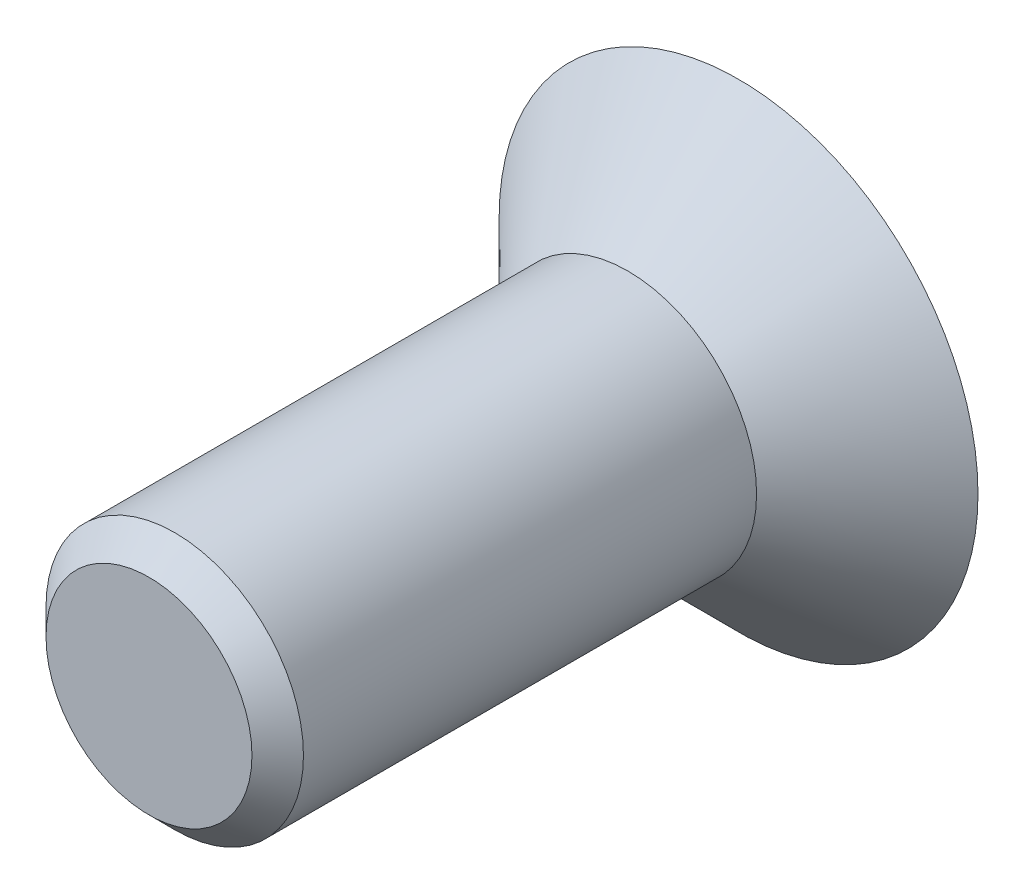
ISO-10303-21;
HEADER;
FILE_DESCRIPTION(('STEP AP214'),'2;1');
FILE_NAME('part.step','',(''),(''),'','','');
FILE_SCHEMA(('AUTOMOTIVE_DESIGN { 1 0 10303 214 1 1 1 1 }'));
ENDSEC;
DATA;
#1=APPLICATION_CONTEXT('core data for automotive mechanical design processes');
#2=APPLICATION_PROTOCOL_DEFINITION('international standard','automotive_design',2000,#1);
#3=PRODUCT_CONTEXT('',#1,'mechanical');
#4=PRODUCT('Part','Part','',(#3));
#5=PRODUCT_RELATED_PRODUCT_CATEGORY('part','',(#4));
#6=PRODUCT_DEFINITION_FORMATION('','',#4);
#7=PRODUCT_DEFINITION_CONTEXT('part definition',#1,'design');
#8=PRODUCT_DEFINITION('design','',#6,#7);
#9=PRODUCT_DEFINITION_SHAPE('','',#8);
#10=(LENGTH_UNIT() NAMED_UNIT(*) SI_UNIT(.MILLI.,.METRE.));
#11=(NAMED_UNIT(*) PLANE_ANGLE_UNIT() SI_UNIT($,.RADIAN.));
#12=(NAMED_UNIT(*) SI_UNIT($,.STERADIAN.) SOLID_ANGLE_UNIT());
#13=UNCERTAINTY_MEASURE_WITH_UNIT(LENGTH_MEASURE(1.E-05),#10,'distance_accuracy_value','');
#14=(GEOMETRIC_REPRESENTATION_CONTEXT(3) GLOBAL_UNCERTAINTY_ASSIGNED_CONTEXT((#13)) GLOBAL_UNIT_ASSIGNED_CONTEXT((#10,
#11,#12)) REPRESENTATION_CONTEXT('',''));
#15=CARTESIAN_POINT('',(0.,0.,0.));
#16=DIRECTION('',(0.,0.,1.));
#17=DIRECTION('',(1.,0.,0.));
#18=AXIS2_PLACEMENT_3D('',#15,#16,#17);
#19=CARTESIAN_POINT('',(0.,0.,-2.15));
#20=DIRECTION('',(0.,0.,1.));
#21=DIRECTION('',(1.,0.,0.));
#22=AXIS2_PLACEMENT_3D('',#19,#20,#21);
#23=PLANE('',#22);
#24=CARTESIAN_POINT('',(0.,0.,-2.14999999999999));
#25=DIRECTION('',(0.,0.,-1.));
#26=DIRECTION('',(-1.,0.,0.));
#27=AXIS2_PLACEMENT_3D('',#24,#25,#26);
#28=CIRCLE('',#27,4.65);
#29=CARTESIAN_POINT('',(-4.65000000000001,0.,-2.14999999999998));
#30=VERTEX_POINT('',#29);
#31=EDGE_CURVE('E98',#30,#30,#28,.T.);
#32=ORIENTED_EDGE('',*,*,#31,.T.);
#33=EDGE_LOOP('',(#32));
#34=FACE_BOUND('',#33,.T.);
#35=DIRECTION('',(-0.866025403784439,0.499999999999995,0.));
#36=VECTOR('',#35,1.);
#37=CARTESIAN_POINT('',(0.,1.73205080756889,-2.14999999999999));
#38=LINE('',#37,#36);
#39=CARTESIAN_POINT('',(1.49999999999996,0.866025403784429,-2.14999999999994));
#40=VERTEX_POINT('',#39);
#41=CARTESIAN_POINT('',(0.,1.73205080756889,-2.14999999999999));
#42=VERTEX_POINT('',#41);
#43=EDGE_CURVE('E45',#40,#42,#38,.T.);
#44=ORIENTED_EDGE('',*,*,#43,.T.);
#45=DIRECTION('',(-0.866025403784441,-0.500000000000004,0.));
#46=VECTOR('',#45,1.);
#47=CARTESIAN_POINT('',(-1.50000000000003,0.866025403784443,-2.15000000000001));
#48=LINE('',#47,#46);
#49=CARTESIAN_POINT('',(-1.50000000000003,0.866025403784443,-2.15000000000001));
#50=VERTEX_POINT('',#49);
#51=EDGE_CURVE('E97',#42,#50,#48,.T.);
#52=ORIENTED_EDGE('',*,*,#51,.T.);
#53=DIRECTION('',(0.,-1.,0.));
#54=VECTOR('',#53,1.);
#55=CARTESIAN_POINT('',(-1.50000000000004,-0.866025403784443,-2.14999999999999));
#56=LINE('',#55,#54);
#57=CARTESIAN_POINT('',(-1.50000000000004,-0.866025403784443,-2.14999999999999));
#58=VERTEX_POINT('',#57);
#59=EDGE_CURVE('E148',#50,#58,#56,.T.);
#60=ORIENTED_EDGE('',*,*,#59,.T.);
#61=DIRECTION('',(0.866025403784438,-0.499999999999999,0.));
#62=VECTOR('',#61,1.);
#63=CARTESIAN_POINT('',(-1.50000000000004,-0.866025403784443,-2.14999999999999));
#64=LINE('',#63,#62);
#65=CARTESIAN_POINT('',(0.,-1.73205080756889,-2.15));
#66=VERTEX_POINT('',#65);
#67=EDGE_CURVE('E154',#58,#66,#64,.T.);
#68=ORIENTED_EDGE('',*,*,#67,.T.);
#69=DIRECTION('',(0.866025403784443,0.500000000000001,0.));
#70=VECTOR('',#69,1.);
#71=CARTESIAN_POINT('',(0.,-1.73205080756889,-2.15));
#72=LINE('',#71,#70);
#73=CARTESIAN_POINT('',(1.49999999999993,-0.866025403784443,-2.14999999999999));
#74=VERTEX_POINT('',#73);
#75=EDGE_CURVE('E157',#66,#74,#72,.T.);
#76=ORIENTED_EDGE('',*,*,#75,.T.);
#77=DIRECTION('',(0.,1.,0.));
#78=VECTOR('',#77,1.);
#79=CARTESIAN_POINT('',(1.49999999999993,-0.866025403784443,-2.14999999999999));
#80=LINE('',#79,#78);
#81=EDGE_CURVE('E145',#74,#40,#80,.T.);
#82=ORIENTED_EDGE('',*,*,#81,.T.);
#83=EDGE_LOOP('',(#44,#52,#60,#68,#76,#82));
#84=FACE_BOUND('',#83,.T.);
#85=ADVANCED_FACE('F31',(#34,#84),#23,.F.);
#86=CARTESIAN_POINT('',(0.,0.,0.));
#87=DIRECTION('',(0.,0.,-1.));
#88=DIRECTION('',(-1.,0.,0.));
#89=AXIS2_PLACEMENT_3D('',#86,#87,#88);
#90=CONICAL_SURFACE('',#89,2.5,0.78539816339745);
#91=CARTESIAN_POINT('',(0.,0.,0.));
#92=DIRECTION('',(0.,0.,1.));
#93=DIRECTION('',(1.,0.,0.));
#94=AXIS2_PLACEMENT_3D('',#91,#92,#93);
#95=CIRCLE('',#94,2.5);
#96=CARTESIAN_POINT('',(-2.50000000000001,0.,0.));
#97=VERTEX_POINT('',#96);
#98=EDGE_CURVE('E146',#97,#97,#95,.T.);
#99=CARTESIAN_POINT('',(-4.65000000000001,0.,-2.14999999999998));
#100=CARTESIAN_POINT('',(-4.62760416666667,0.,-2.12760416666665));
#101=CARTESIAN_POINT('',(-4.60520833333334,0.,-2.10520833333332));
#102=CARTESIAN_POINT('',(-4.56041666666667,0.,-2.06041666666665));
#103=CARTESIAN_POINT('',(-4.53802083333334,0.,-2.03802083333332));
#104=CARTESIAN_POINT('',(-4.49322916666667,0.,-1.99322916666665));
#105=CARTESIAN_POINT('',(-4.47083333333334,0.,-1.97083333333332));
#106=CARTESIAN_POINT('',(-4.42604166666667,0.,-1.92604166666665));
#107=CARTESIAN_POINT('',(-4.40364583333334,0.,-1.90364583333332));
#108=CARTESIAN_POINT('',(-4.35885416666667,0.,-1.85885416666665));
#109=CARTESIAN_POINT('',(-4.33645833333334,0.,-1.83645833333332));
#110=CARTESIAN_POINT('',(-4.29166666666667,0.,-1.79166666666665));
#111=CARTESIAN_POINT('',(-4.26927083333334,0.,-1.76927083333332));
#112=CARTESIAN_POINT('',(-4.22447916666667,0.,-1.72447916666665));
#113=CARTESIAN_POINT('',(-4.20208333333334,0.,-1.70208333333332));
#114=CARTESIAN_POINT('',(-4.15729166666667,0.,-1.65729166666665));
#115=CARTESIAN_POINT('',(-4.13489583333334,0.,-1.63489583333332));
#116=CARTESIAN_POINT('',(-4.09010416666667,0.,-1.59010416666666));
#117=CARTESIAN_POINT('',(-4.06770833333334,0.,-1.56770833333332));
#118=CARTESIAN_POINT('',(-4.02291666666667,0.,-1.52291666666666));
#119=CARTESIAN_POINT('',(-4.00052083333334,0.,-1.50052083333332));
#120=CARTESIAN_POINT('',(-3.95572916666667,0.,-1.45572916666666));
#121=CARTESIAN_POINT('',(-3.93333333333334,0.,-1.43333333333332));
#122=CARTESIAN_POINT('',(-3.88854166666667,0.,-1.38854166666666));
#123=CARTESIAN_POINT('',(-3.86614583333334,0.,-1.36614583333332));
#124=CARTESIAN_POINT('',(-3.82135416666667,0.,-1.32135416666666));
#125=CARTESIAN_POINT('',(-3.79895833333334,0.,-1.29895833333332));
#126=CARTESIAN_POINT('',(-3.75416666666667,0.,-1.25416666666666));
#127=CARTESIAN_POINT('',(-3.73177083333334,0.,-1.23177083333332));
#128=CARTESIAN_POINT('',(-3.68697916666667,0.,-1.18697916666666));
#129=CARTESIAN_POINT('',(-3.66458333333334,0.,-1.16458333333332));
#130=CARTESIAN_POINT('',(-3.61979166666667,0.,-1.11979166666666));
#131=CARTESIAN_POINT('',(-3.59739583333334,0.,-1.09739583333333));
#132=CARTESIAN_POINT('',(-3.55260416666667,0.,-1.05260416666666));
#133=CARTESIAN_POINT('',(-3.53020833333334,0.,-1.03020833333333));
#134=CARTESIAN_POINT('',(-3.48541666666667,0.,-0.985416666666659));
#135=CARTESIAN_POINT('',(-3.46302083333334,0.,-0.963020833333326));
#136=CARTESIAN_POINT('',(-3.41822916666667,0.,-0.91822916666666));
#137=CARTESIAN_POINT('',(-3.39583333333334,0.,-0.895833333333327));
#138=CARTESIAN_POINT('',(-3.35104166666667,0.,-0.85104166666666));
#139=CARTESIAN_POINT('',(-3.32864583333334,0.,-0.828645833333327));
#140=CARTESIAN_POINT('',(-3.28385416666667,0.,-0.783854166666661));
#141=CARTESIAN_POINT('',(-3.26145833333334,0.,-0.761458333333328));
#142=CARTESIAN_POINT('',(-3.21666666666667,0.,-0.716666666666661));
#143=CARTESIAN_POINT('',(-3.19427083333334,0.,-0.694270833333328));
#144=CARTESIAN_POINT('',(-3.14947916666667,0.,-0.649479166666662));
#145=CARTESIAN_POINT('',(-3.12708333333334,0.,-0.627083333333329));
#146=CARTESIAN_POINT('',(-3.08229166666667,0.,-0.582291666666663));
#147=CARTESIAN_POINT('',(-3.05989583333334,0.,-0.559895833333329));
#148=CARTESIAN_POINT('',(-3.01510416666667,0.,-0.515104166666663));
#149=CARTESIAN_POINT('',(-2.99270833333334,0.,-0.492708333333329));
#150=CARTESIAN_POINT('',(-2.94791666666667,0.,-0.447916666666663));
#151=CARTESIAN_POINT('',(-2.92552083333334,0.,-0.42552083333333));
#152=CARTESIAN_POINT('',(-2.88072916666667,0.,-0.380729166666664));
#153=CARTESIAN_POINT('',(-2.85833333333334,0.,-0.358333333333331));
#154=CARTESIAN_POINT('',(-2.81354166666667,0.,-0.313541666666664));
#155=CARTESIAN_POINT('',(-2.79114583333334,0.,-0.291145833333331));
#156=CARTESIAN_POINT('',(-2.74635416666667,0.,-0.246354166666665));
#157=CARTESIAN_POINT('',(-2.72395833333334,0.,-0.223958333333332));
#158=CARTESIAN_POINT('',(-2.67916666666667,0.,-0.179166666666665));
#159=CARTESIAN_POINT('',(-2.65677083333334,0.,-0.156770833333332));
#160=CARTESIAN_POINT('',(-2.61197916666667,0.,-0.111979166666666));
#161=CARTESIAN_POINT('',(-2.58958333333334,0.,-0.0895833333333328));
#162=CARTESIAN_POINT('',(-2.54479166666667,0.,-0.0447916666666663));
#163=CARTESIAN_POINT('',(-2.52239583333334,0.,-0.0223958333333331));
#164=CARTESIAN_POINT('',(-2.50000000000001,0.,0.));
#165=B_SPLINE_CURVE_WITH_KNOTS('',3,(#99,#100,#101,#102,#103,#104,#105,#106,#107,#108,#109,#110,
#111,#112,#113,#114,#115,#116,#117,#118,#119,#120,#121,#122,#123,#124,#125,#126,#127,#128,#129,
#130,#131,#132,#133,#134,#135,#136,#137,#138,#139,#140,#141,#142,#143,#144,#145,#146,#147,#148,
#149,#150,#151,#152,#153,#154,#155,#156,#157,#158,#159,#160,#161,#162,#163,#164),.UNSPECIFIED.,
.F.,.F.,(4,2,2,2,2,2,2,2,2,2,2,2,2,2,2,2,2,2,2,2,2,2,2,2,2,2,2,2,2,2,2,2,4),(0.,
0.0950174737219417,0.190034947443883,0.285052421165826,0.380069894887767,0.47508736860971,
0.570104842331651,0.665122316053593,0.760139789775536,0.855157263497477,0.950174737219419,
1.04519221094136,1.1402096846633,1.23522715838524,1.33024463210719,1.42526210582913,
1.52027957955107,1.61529705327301,1.71031452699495,1.8053320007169,1.90034947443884,
1.99536694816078,2.09038442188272,2.18540189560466,2.28041936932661,2.37543684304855,
2.47045431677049,2.56547179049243,2.66048926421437,2.75550673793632,2.85052421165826,
2.9455416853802,3.04055915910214),.UNSPECIFIED.);
#166=EDGE_CURVE('BSEAM133',#30,#97,#165,.T.);
#167=ORIENTED_EDGE('',*,*,#31,.F.);
#168=ORIENTED_EDGE('',*,*,#98,.F.);
#169=ORIENTED_EDGE('',*,*,#166,.T.);
#170=ORIENTED_EDGE('',*,*,#166,.F.);
#171=EDGE_LOOP('',(#167,#169,#168,#170));
#172=FACE_BOUND('',#171,.T.);
#173=ADVANCED_FACE('F133',(#172),#90,.T.);
#174=CARTESIAN_POINT('',(0.,1.73205080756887,0.250000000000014));
#175=DIRECTION('',(-0.500000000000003,-0.866025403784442,0.));
#176=DIRECTION('',(0.866025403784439,-0.499999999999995,0.));
#177=AXIS2_PLACEMENT_3D('',#174,#175,#176);
#178=PLANE('',#177);
#179=DIRECTION('',(-0.866025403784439,0.499999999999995,0.));
#180=VECTOR('',#179,1.);
#181=CARTESIAN_POINT('',(0.749999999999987,1.29903810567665,0.));
#182=LINE('',#181,#180);
#183=CARTESIAN_POINT('',(1.5,0.866025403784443,0.));
#184=VERTEX_POINT('',#183);
#185=CARTESIAN_POINT('',(0.,1.73205080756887,0.));
#186=VERTEX_POINT('',#185);
#187=EDGE_CURVE('E84',#184,#186,#182,.T.);
#188=ORIENTED_EDGE('',*,*,#187,.T.);
#189=DIRECTION('',(0.,0.,-1.));
#190=VECTOR('',#189,1.);
#191=CARTESIAN_POINT('',(0.,1.73205080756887,0.250000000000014));
#192=LINE('',#191,#190);
#193=EDGE_CURVE('E91',#186,#42,#192,.T.);
#194=ORIENTED_EDGE('',*,*,#193,.T.);
#195=ORIENTED_EDGE('',*,*,#43,.F.);
#196=DIRECTION('',(0.,0.,-1.));
#197=VECTOR('',#196,1.);
#198=CARTESIAN_POINT('',(1.49999999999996,0.866025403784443,0.250000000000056));
#199=LINE('',#198,#197);
#200=EDGE_CURVE('E93',#184,#40,#199,.T.);
#201=ORIENTED_EDGE('',*,*,#200,.F.);
#202=EDGE_LOOP('',(#188,#194,#195,#201));
#203=FACE_BOUND('',#202,.T.);
#204=ADVANCED_FACE('F90',(#203),#178,.T.);
#205=CARTESIAN_POINT('',(-1.50000000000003,0.866025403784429,0.25));
#206=DIRECTION('',(0.499999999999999,-0.866025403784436,0.));
#207=DIRECTION('',(0.866025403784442,0.500000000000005,0.));
#208=AXIS2_PLACEMENT_3D('',#205,#206,#207);
#209=PLANE('',#208);
#210=DIRECTION('',(-0.866025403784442,-0.500000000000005,0.));
#211=VECTOR('',#210,1.);
#212=CARTESIAN_POINT('',(-0.750000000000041,1.29903810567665,0.));
#213=LINE('',#212,#211);
#214=CARTESIAN_POINT('',(-1.50000000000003,0.866025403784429,0.));
#215=VERTEX_POINT('',#214);
#216=EDGE_CURVE('E81',#186,#215,#213,.T.);
#217=ORIENTED_EDGE('',*,*,#216,.T.);
#218=DIRECTION('',(0.,0.,-1.));
#219=VECTOR('',#218,1.);
#220=CARTESIAN_POINT('',(-1.50000000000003,0.866025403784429,0.25));
#221=LINE('',#220,#219);
#222=EDGE_CURVE('E99',#215,#50,#221,.T.);
#223=ORIENTED_EDGE('',*,*,#222,.T.);
#224=ORIENTED_EDGE('',*,*,#51,.F.);
#225=ORIENTED_EDGE('',*,*,#193,.F.);
#226=EDGE_LOOP('',(#217,#223,#224,#225));
#227=FACE_BOUND('',#226,.T.);
#228=ADVANCED_FACE('F95',(#227),#209,.T.);
#229=CARTESIAN_POINT('',(-1.50000000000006,-0.866025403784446,0.250000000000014));
#230=DIRECTION('',(1.,0.,0.));
#231=DIRECTION('',(0.,0.,-1.));
#232=AXIS2_PLACEMENT_3D('',#229,#230,#231);
#233=PLANE('',#232);
#234=DIRECTION('',(0.,-1.,0.));
#235=VECTOR('',#234,1.);
#236=CARTESIAN_POINT('',(-1.50000000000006,0.,0.));
#237=LINE('',#236,#235);
#238=CARTESIAN_POINT('',(-1.50000000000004,-0.86602540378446,0.));
#239=VERTEX_POINT('',#238);
#240=EDGE_CURVE('E53',#215,#239,#237,.T.);
#241=ORIENTED_EDGE('',*,*,#240,.T.);
#242=DIRECTION('',(0.,0.,-1.));
#243=VECTOR('',#242,1.);
#244=CARTESIAN_POINT('',(-1.50000000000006,-0.866025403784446,0.250000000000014));
#245=LINE('',#244,#243);
#246=EDGE_CURVE('E104',#239,#58,#245,.T.);
#247=ORIENTED_EDGE('',*,*,#246,.T.);
#248=ORIENTED_EDGE('',*,*,#59,.F.);
#249=ORIENTED_EDGE('',*,*,#222,.F.);
#250=EDGE_LOOP('',(#241,#247,#248,#249));
#251=FACE_BOUND('',#250,.T.);
#252=ADVANCED_FACE('F168',(#251),#233,.T.);
#253=CARTESIAN_POINT('',(-1.50000000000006,-0.866025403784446,0.250000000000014));
#254=DIRECTION('',(0.500000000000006,0.866025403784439,0.));
#255=DIRECTION('',(-0.866025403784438,0.499999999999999,0.));
#256=AXIS2_PLACEMENT_3D('',#253,#254,#255);
#257=PLANE('',#256);
#258=DIRECTION('',(0.866025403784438,-0.499999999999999,0.));
#259=VECTOR('',#258,1.);
#260=CARTESIAN_POINT('',(-0.750000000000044,-1.2990381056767,0.));
#261=LINE('',#260,#259);
#262=CARTESIAN_POINT('',(0.,-1.73205080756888,0.));
#263=VERTEX_POINT('',#262);
#264=EDGE_CURVE('E112',#239,#263,#261,.T.);
#265=ORIENTED_EDGE('',*,*,#264,.T.);
#266=DIRECTION('',(0.,0.,-1.));
#267=VECTOR('',#266,1.);
#268=CARTESIAN_POINT('',(0.,-1.7320508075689,0.25));
#269=LINE('',#268,#267);
#270=EDGE_CURVE('E163',#263,#66,#269,.T.);
#271=ORIENTED_EDGE('',*,*,#270,.T.);
#272=ORIENTED_EDGE('',*,*,#67,.F.);
#273=ORIENTED_EDGE('',*,*,#246,.F.);
#274=EDGE_LOOP('',(#265,#271,#272,#273));
#275=FACE_BOUND('',#274,.T.);
#276=ADVANCED_FACE('F170',(#275),#257,.T.);
#277=CARTESIAN_POINT('',(0.,-1.7320508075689,0.25));
#278=DIRECTION('',(-0.499999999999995,0.866025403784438,0.));
#279=DIRECTION('',(-0.866025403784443,-0.500000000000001,0.));
#280=AXIS2_PLACEMENT_3D('',#277,#278,#279);
#281=PLANE('',#280);
#282=DIRECTION('',(0.866025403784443,0.500000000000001,0.));
#283=VECTOR('',#282,1.);
#284=CARTESIAN_POINT('',(0.749999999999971,-1.29903810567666,0.));
#285=LINE('',#284,#283);
#286=CARTESIAN_POINT('',(1.5,-0.866025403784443,0.));
#287=VERTEX_POINT('',#286);
#288=EDGE_CURVE('E109',#263,#287,#285,.T.);
#289=ORIENTED_EDGE('',*,*,#288,.T.);
#290=DIRECTION('',(0.,0.,-1.));
#291=VECTOR('',#290,1.);
#292=CARTESIAN_POINT('',(1.49999999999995,-0.866025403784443,0.250000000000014));
#293=LINE('',#292,#291);
#294=EDGE_CURVE('E161',#287,#74,#293,.T.);
#295=ORIENTED_EDGE('',*,*,#294,.T.);
#296=ORIENTED_EDGE('',*,*,#75,.F.);
#297=ORIENTED_EDGE('',*,*,#270,.F.);
#298=EDGE_LOOP('',(#289,#295,#296,#297));
#299=FACE_BOUND('',#298,.T.);
#300=ADVANCED_FACE('F174',(#299),#281,.T.);
#301=CARTESIAN_POINT('',(1.49999999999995,-0.866025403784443,0.250000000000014));
#302=DIRECTION('',(-1.,0.,0.));
#303=DIRECTION('',(0.,0.,1.));
#304=AXIS2_PLACEMENT_3D('',#301,#302,#303);
#305=PLANE('',#304);
#306=DIRECTION('',(0.,1.,0.));
#307=VECTOR('',#306,1.);
#308=CARTESIAN_POINT('',(1.49999999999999,0.,0.));
#309=LINE('',#308,#307);
#310=EDGE_CURVE('E102',#287,#184,#309,.T.);
#311=ORIENTED_EDGE('',*,*,#310,.T.);
#312=ORIENTED_EDGE('',*,*,#200,.T.);
#313=ORIENTED_EDGE('',*,*,#81,.F.);
#314=ORIENTED_EDGE('',*,*,#294,.F.);
#315=EDGE_LOOP('',(#311,#312,#313,#314));
#316=FACE_BOUND('',#315,.T.);
#317=ADVANCED_FACE('F177',(#316),#305,.T.);
#318=CARTESIAN_POINT('',(0.,0.,0.));
#319=DIRECTION('',(0.,0.,-1.));
#320=DIRECTION('',(-1.,0.,0.));
#321=AXIS2_PLACEMENT_3D('',#318,#319,#320);
#322=PLANE('',#321);
#323=ORIENTED_EDGE('',*,*,#187,.F.);
#324=ORIENTED_EDGE('',*,*,#310,.F.);
#325=ORIENTED_EDGE('',*,*,#288,.F.);
#326=ORIENTED_EDGE('',*,*,#264,.F.);
#327=ORIENTED_EDGE('',*,*,#240,.F.);
#328=ORIENTED_EDGE('',*,*,#216,.F.);
#329=EDGE_LOOP('',(#323,#324,#325,#326,#327,#328));
#330=FACE_BOUND('',#329,.T.);
#331=ADVANCED_FACE('F83',(#330),#322,.T.);
#332=CARTESIAN_POINT('',(0.,0.,9.3));
#333=DIRECTION('',(0.,0.,1.));
#334=DIRECTION('',(1.,0.,0.));
#335=AXIS2_PLACEMENT_3D('',#332,#333,#334);
#336=PLANE('',#335);
#337=CARTESIAN_POINT('',(0.,0.,9.3));
#338=DIRECTION('',(0.,0.,1.));
#339=DIRECTION('',(1.,0.,0.));
#340=AXIS2_PLACEMENT_3D('',#337,#338,#339);
#341=CIRCLE('',#340,1.99999999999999);
#342=CARTESIAN_POINT('',(-2.00000000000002,0.,9.3));
#343=VERTEX_POINT('',#342);
#344=EDGE_CURVE('E38',#343,#343,#341,.T.);
#345=ORIENTED_EDGE('',*,*,#344,.T.);
#346=EDGE_LOOP('',(#345));
#347=FACE_BOUND('',#346,.T.);
#348=ADVANCED_FACE('F118',(#347),#336,.T.);
#349=CARTESIAN_POINT('',(0.,0.,0.));
#350=DIRECTION('',(0.,0.,1.));
#351=DIRECTION('',(1.,0.,0.));
#352=AXIS2_PLACEMENT_3D('',#349,#350,#351);
#353=CYLINDRICAL_SURFACE('',#352,2.5);
#354=CARTESIAN_POINT('',(0.,0.,8.8));
#355=DIRECTION('',(0.,0.,1.));
#356=DIRECTION('',(1.,0.,0.));
#357=AXIS2_PLACEMENT_3D('',#354,#355,#356);
#358=CIRCLE('',#357,2.5);
#359=CARTESIAN_POINT('',(-2.50000000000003,0.,8.8));
#360=VERTEX_POINT('',#359);
#361=EDGE_CURVE('E11',#360,#360,#358,.F.);
#362=ORIENTED_EDGE('',*,*,#361,.T.);
#363=EDGE_LOOP('',(#362));
#364=FACE_BOUND('',#363,.T.);
#365=ORIENTED_EDGE('',*,*,#98,.T.);
#366=EDGE_LOOP('',(#365));
#367=FACE_BOUND('',#366,.T.);
#368=ADVANCED_FACE('F122',(#364,#367),#353,.T.);
#369=CARTESIAN_POINT('',(0.,0.,9.3));
#370=DIRECTION('',(0.,0.,-1.));
#371=DIRECTION('',(-1.,0.,0.));
#372=AXIS2_PLACEMENT_3D('',#369,#370,#371);
#373=CONICAL_SURFACE('',#372,1.99999999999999,0.785398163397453);
#374=CARTESIAN_POINT('',(-2.50000000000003,0.,8.8));
#375=CARTESIAN_POINT('',(-2.49479166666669,0.,8.80520833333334));
#376=CARTESIAN_POINT('',(-2.48958333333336,0.,8.81041666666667));
#377=CARTESIAN_POINT('',(-2.47916666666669,0.,8.82083333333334));
#378=CARTESIAN_POINT('',(-2.47395833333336,0.,8.82604166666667));
#379=CARTESIAN_POINT('',(-2.46354166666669,0.,8.83645833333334));
#380=CARTESIAN_POINT('',(-2.45833333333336,0.,8.84166666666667));
#381=CARTESIAN_POINT('',(-2.44791666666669,0.,8.85208333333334));
#382=CARTESIAN_POINT('',(-2.44270833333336,0.,8.85729166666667));
#383=CARTESIAN_POINT('',(-2.43229166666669,0.,8.86770833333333));
#384=CARTESIAN_POINT('',(-2.42708333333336,0.,8.87291666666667));
#385=CARTESIAN_POINT('',(-2.41666666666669,0.,8.88333333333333));
#386=CARTESIAN_POINT('',(-2.41145833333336,0.,8.88854166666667));
#387=CARTESIAN_POINT('',(-2.40104166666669,0.,8.89895833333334));
#388=CARTESIAN_POINT('',(-2.39583333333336,0.,8.90416666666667));
#389=CARTESIAN_POINT('',(-2.38541666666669,0.,8.91458333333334));
#390=CARTESIAN_POINT('',(-2.38020833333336,0.,8.91979166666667));
#391=CARTESIAN_POINT('',(-2.36979166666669,0.,8.93020833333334));
#392=CARTESIAN_POINT('',(-2.36458333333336,0.,8.93541666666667));
#393=CARTESIAN_POINT('',(-2.35416666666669,0.,8.94583333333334));
#394=CARTESIAN_POINT('',(-2.34895833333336,0.,8.95104166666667));
#395=CARTESIAN_POINT('',(-2.33854166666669,0.,8.96145833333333));
#396=CARTESIAN_POINT('',(-2.33333333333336,0.,8.96666666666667));
#397=CARTESIAN_POINT('',(-2.32291666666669,0.,8.97708333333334));
#398=CARTESIAN_POINT('',(-2.31770833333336,0.,8.98229166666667));
#399=CARTESIAN_POINT('',(-2.30729166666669,0.,8.99270833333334));
#400=CARTESIAN_POINT('',(-2.30208333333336,0.,8.99791666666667));
#401=CARTESIAN_POINT('',(-2.29166666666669,0.,9.00833333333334));
#402=CARTESIAN_POINT('',(-2.28645833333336,0.,9.01354166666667));
#403=CARTESIAN_POINT('',(-2.27604166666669,0.,9.02395833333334));
#404=CARTESIAN_POINT('',(-2.27083333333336,0.,9.02916666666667));
#405=CARTESIAN_POINT('',(-2.26041666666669,0.,9.03958333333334));
#406=CARTESIAN_POINT('',(-2.25520833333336,0.,9.04479166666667));
#407=CARTESIAN_POINT('',(-2.24479166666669,0.,9.05520833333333));
#408=CARTESIAN_POINT('',(-2.23958333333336,0.,9.06041666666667));
#409=CARTESIAN_POINT('',(-2.22916666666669,0.,9.07083333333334));
#410=CARTESIAN_POINT('',(-2.22395833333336,0.,9.07604166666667));
#411=CARTESIAN_POINT('',(-2.21354166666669,0.,9.08645833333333));
#412=CARTESIAN_POINT('',(-2.20833333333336,0.,9.09166666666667));
#413=CARTESIAN_POINT('',(-2.19791666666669,0.,9.10208333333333));
#414=CARTESIAN_POINT('',(-2.19270833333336,0.,9.10729166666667));
#415=CARTESIAN_POINT('',(-2.18229166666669,0.,9.11770833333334));
#416=CARTESIAN_POINT('',(-2.17708333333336,0.,9.12291666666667));
#417=CARTESIAN_POINT('',(-2.16666666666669,0.,9.13333333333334));
#418=CARTESIAN_POINT('',(-2.16145833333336,0.,9.13854166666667));
#419=CARTESIAN_POINT('',(-2.15104166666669,0.,9.14895833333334));
#420=CARTESIAN_POINT('',(-2.14583333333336,0.,9.15416666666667));
#421=CARTESIAN_POINT('',(-2.13541666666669,0.,9.16458333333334));
#422=CARTESIAN_POINT('',(-2.13020833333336,0.,9.16979166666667));
#423=CARTESIAN_POINT('',(-2.11979166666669,0.,9.18020833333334));
#424=CARTESIAN_POINT('',(-2.11458333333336,0.,9.18541666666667));
#425=CARTESIAN_POINT('',(-2.10416666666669,0.,9.19583333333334));
#426=CARTESIAN_POINT('',(-2.09895833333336,0.,9.20104166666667));
#427=CARTESIAN_POINT('',(-2.08854166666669,0.,9.21145833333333));
#428=CARTESIAN_POINT('',(-2.08333333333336,0.,9.21666666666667));
#429=CARTESIAN_POINT('',(-2.07291666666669,0.,9.22708333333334));
#430=CARTESIAN_POINT('',(-2.06770833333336,0.,9.23229166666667));
#431=CARTESIAN_POINT('',(-2.05729166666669,0.,9.24270833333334));
#432=CARTESIAN_POINT('',(-2.05208333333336,0.,9.24791666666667));
#433=CARTESIAN_POINT('',(-2.04166666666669,0.,9.25833333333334));
#434=CARTESIAN_POINT('',(-2.03645833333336,0.,9.26354166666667));
#435=CARTESIAN_POINT('',(-2.02604166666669,0.,9.27395833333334));
#436=CARTESIAN_POINT('',(-2.02083333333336,0.,9.27916666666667));
#437=CARTESIAN_POINT('',(-2.01041666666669,0.,9.28958333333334));
#438=CARTESIAN_POINT('',(-2.00520833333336,0.,9.29479166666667));
#439=CARTESIAN_POINT('',(-2.00000000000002,0.,9.3));
#440=B_SPLINE_CURVE_WITH_KNOTS('',3,(#374,#375,#376,#377,#378,#379,#380,#381,#382,#383,#384,
#385,#386,#387,#388,#389,#390,#391,#392,#393,#394,#395,#396,#397,#398,#399,#400,#401,#402,#403,
#404,#405,#406,#407,#408,#409,#410,#411,#412,#413,#414,#415,#416,#417,#418,#419,#420,#421,#422,
#423,#424,#425,#426,#427,#428,#429,#430,#431,#432,#433,#434,#435,#436,#437,#438,#439),
.UNSPECIFIED.,.F.,.F.,(4,2,2,2,2,2,2,2,2,2,2,2,2,2,2,2,2,2,2,2,2,2,2,2,2,2,2,2,2,2,2,2,4),(0.,
0.0220970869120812,0.0441941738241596,0.0662912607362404,0.0883883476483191,0.110485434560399,
0.132582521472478,0.15467960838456,0.176776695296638,0.198873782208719,0.220970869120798,
0.243067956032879,0.265165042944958,0.287262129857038,0.309359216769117,0.331456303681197,
0.353553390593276,0.375650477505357,0.397747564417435,0.419844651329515,0.441941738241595,
0.464038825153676,0.486135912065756,0.508232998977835,0.530330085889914,0.552427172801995,
0.574524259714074,0.596621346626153,0.618718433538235,0.640815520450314,0.662912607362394,
0.685009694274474,0.707106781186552),.UNSPECIFIED.);
#441=EDGE_CURVE('BSEAM120',#360,#343,#440,.T.);
#442=ORIENTED_EDGE('',*,*,#361,.F.);
#443=ORIENTED_EDGE('',*,*,#344,.F.);
#444=ORIENTED_EDGE('',*,*,#441,.T.);
#445=ORIENTED_EDGE('',*,*,#441,.F.);
#446=EDGE_LOOP('',(#442,#444,#443,#445));
#447=FACE_BOUND('',#446,.T.);
#448=ADVANCED_FACE('F120',(#447),#373,.T.);
#449=CLOSED_SHELL('',(#85,#173,#204,#228,#252,#276,#300,#317,#331,#348,#368,#448));
#450=MANIFOLD_SOLID_BREP('B2',#449);
#451=ADVANCED_BREP_SHAPE_REPRESENTATION('',(#18,#450),#14);
#452=SHAPE_DEFINITION_REPRESENTATION(#9,#451);
ENDSEC;
END-ISO-10303-21;
